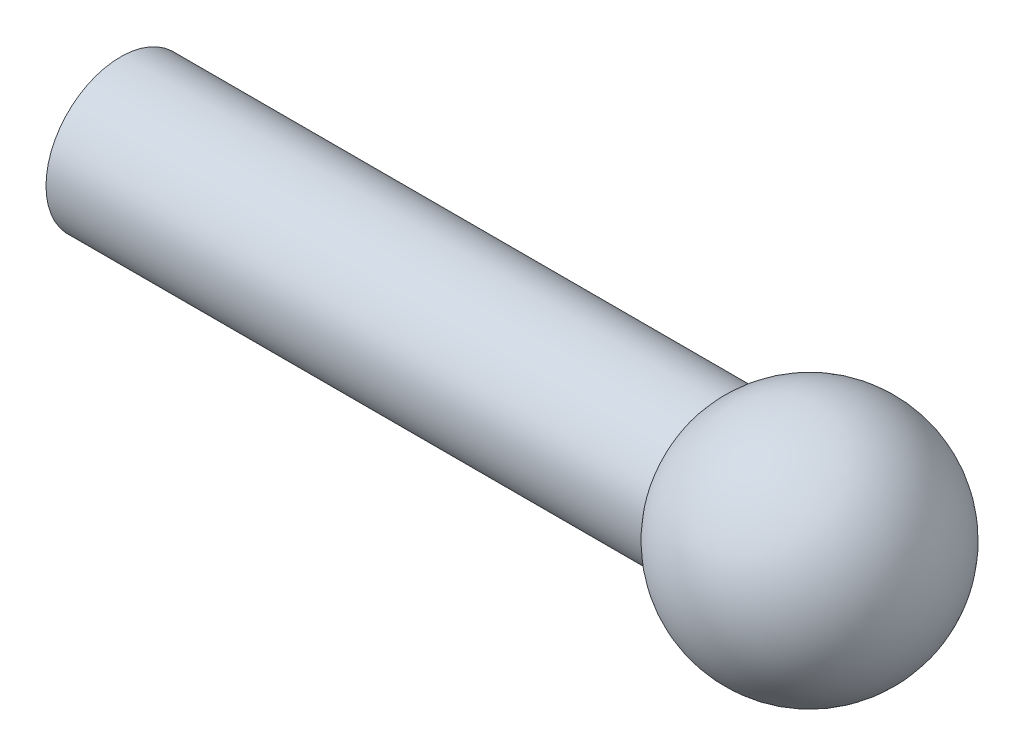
ISO-10303-21;
HEADER;
FILE_DESCRIPTION(('STEP AP214'),'2;1');
FILE_NAME('part.step','',(''),(''),'','','');
FILE_SCHEMA(('AUTOMOTIVE_DESIGN { 1 0 10303 214 1 1 1 1 }'));
ENDSEC;
DATA;
#1=APPLICATION_CONTEXT('core data for automotive mechanical design processes');
#2=APPLICATION_PROTOCOL_DEFINITION('international standard','automotive_design',2000,#1);
#3=PRODUCT_CONTEXT('',#1,'mechanical');
#4=PRODUCT('Part','Part','',(#3));
#5=PRODUCT_RELATED_PRODUCT_CATEGORY('part','',(#4));
#6=PRODUCT_DEFINITION_FORMATION('','',#4);
#7=PRODUCT_DEFINITION_CONTEXT('part definition',#1,'design');
#8=PRODUCT_DEFINITION('design','',#6,#7);
#9=PRODUCT_DEFINITION_SHAPE('','',#8);
#10=(LENGTH_UNIT() NAMED_UNIT(*) SI_UNIT(.MILLI.,.METRE.));
#11=(NAMED_UNIT(*) PLANE_ANGLE_UNIT() SI_UNIT($,.RADIAN.));
#12=(NAMED_UNIT(*) SI_UNIT($,.STERADIAN.) SOLID_ANGLE_UNIT());
#13=UNCERTAINTY_MEASURE_WITH_UNIT(LENGTH_MEASURE(1.E-05),#10,'distance_accuracy_value','');
#14=(GEOMETRIC_REPRESENTATION_CONTEXT(3) GLOBAL_UNCERTAINTY_ASSIGNED_CONTEXT((#13)) GLOBAL_UNIT_ASSIGNED_CONTEXT((#10,
#11,#12)) REPRESENTATION_CONTEXT('',''));
#15=CARTESIAN_POINT('',(0.,0.,0.));
#16=DIRECTION('',(0.,0.,1.));
#17=DIRECTION('',(1.,0.,0.));
#18=AXIS2_PLACEMENT_3D('',#15,#16,#17);
#19=CARTESIAN_POINT('',(23.1224989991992,0.,0.));
#20=DIRECTION('',(-1.,0.,0.));
#21=DIRECTION('',(0.,1.,0.));
#22=AXIS2_PLACEMENT_3D('',#19,#20,#21);
#23=SPHERICAL_SURFACE('',#22,4.);
#24=CARTESIAN_POINT('',(20.,0.,0.));
#25=DIRECTION('',(-1.,0.,0.));
#26=DIRECTION('',(0.,0.,1.));
#27=AXIS2_PLACEMENT_3D('',#24,#25,#26);
#28=CIRCLE('',#27,2.5);
#29=CARTESIAN_POINT('',(20.,0.,2.5));
#30=VERTEX_POINT('',#29);
#31=EDGE_CURVE('E10',#30,#30,#28,.T.);
#32=ORIENTED_EDGE('',*,*,#31,.F.);
#33=EDGE_LOOP('',(#32));
#34=FACE_BOUND('',#33,.T.);
#35=ADVANCED_FACE('F29',(#34),#23,.T.);
#36=CARTESIAN_POINT('',(-13.4344806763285,0.,0.));
#37=DIRECTION('',(-1.,0.,0.));
#38=DIRECTION('',(0.,0.,1.));
#39=AXIS2_PLACEMENT_3D('',#36,#37,#38);
#40=CYLINDRICAL_SURFACE('',#39,2.5);
#41=CARTESIAN_POINT('',(0.,0.,0.));
#42=DIRECTION('',(-1.,0.,0.));
#43=DIRECTION('',(0.,0.,1.));
#44=AXIS2_PLACEMENT_3D('',#41,#42,#43);
#45=CIRCLE('',#44,2.5);
#46=CARTESIAN_POINT('',(0.,0.,2.5));
#47=VERTEX_POINT('',#46);
#48=EDGE_CURVE('E35',#47,#47,#45,.T.);
#49=ORIENTED_EDGE('',*,*,#48,.F.);
#50=EDGE_LOOP('',(#49));
#51=FACE_BOUND('',#50,.T.);
#52=ORIENTED_EDGE('',*,*,#31,.T.);
#53=EDGE_LOOP('',(#52));
#54=FACE_BOUND('',#53,.T.);
#55=ADVANCED_FACE('F43',(#51,#54),#40,.T.);
#56=CARTESIAN_POINT('',(0.,0.,0.));
#57=DIRECTION('',(1.,0.,0.));
#58=DIRECTION('',(0.,0.,-1.));
#59=AXIS2_PLACEMENT_3D('',#56,#57,#58);
#60=PLANE('',#59);
#61=ORIENTED_EDGE('',*,*,#48,.T.);
#62=EDGE_LOOP('',(#61));
#63=FACE_BOUND('',#62,.T.);
#64=ADVANCED_FACE('F41',(#63),#60,.F.);
#65=CLOSED_SHELL('',(#35,#55,#64));
#66=MANIFOLD_SOLID_BREP('B2',#65);
#67=ADVANCED_BREP_SHAPE_REPRESENTATION('',(#18,#66),#14);
#68=SHAPE_DEFINITION_REPRESENTATION(#9,#67);
ENDSEC;
END-ISO-10303-21;
